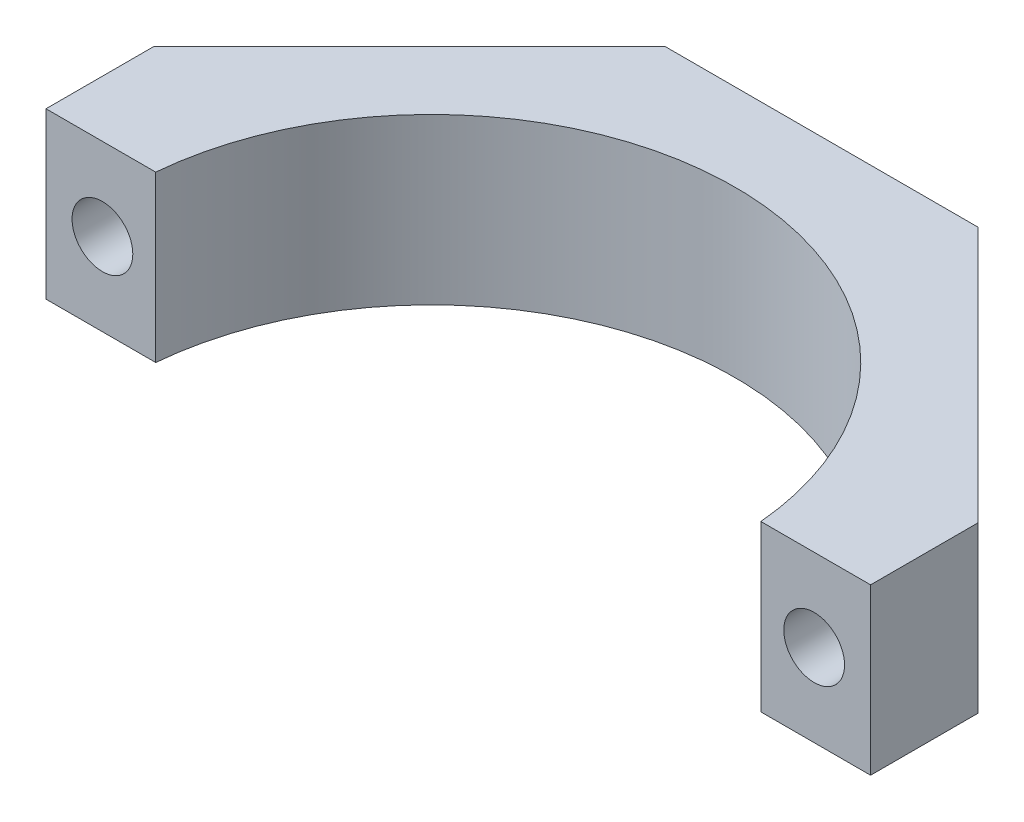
from build123d import *

# Parameters (mm, degrees)
EXTRUDE1_DEPTH          = 9.652
CUT_EXTRUDE1_DEPTH      = 52.446757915
CUT_EXTRUDE1_DEPTH_BACK = 52.446757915
SKETCH2_R               = 1.778
SKETCH3_R               = 3.175
CUT_EXTRUDE2_DEPTH      = 52.446757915
SKETCH4_W               = 50.633246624
SKETCH4_H               = 16.558924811
CUT_EXTRUDE3_DEPTH      = 1.5875


with BuildPart() as part:
    # Sketch1 → Extrude1 (new body)
    with BuildSketch(Plane(origin=(0, 0, 0), x_dir=(1, 0, 0), z_dir=(0, 1, 0))):
        with BuildLine():
            Line((0, 0), (0, 7.874))
            Line((0, 7.874), (14.986, 22.86))
            Line((14.986, 22.86), (33.274, 22.86))
            Line((33.274, 22.86), (48.26, 7.874))
            Line((48.26, 7.874), (48.26, 0))
            Line((48.26, 0), (41.91, 0))
            ThreePointArc((41.91, 0), (24.13, 17.78), (6.35, 0))
            Line((6.35, 0), (0, 0))
        make_face()
    extrude(amount=EXTRUDE1_DEPTH)

    # Sketch2 → Cut-Extrude1 (cut, two sides: drawn at the far end of the back side and taken through both)
    with BuildSketch(Plane.XY.offset(-7.874).offset(-CUT_EXTRUDE1_DEPTH_BACK)):
        with Locations((3.302, 4.826)):
            Circle(SKETCH2_R)
        with Locations((44.958, 4.826)):
            Circle(SKETCH2_R)
    extrude(amount=CUT_EXTRUDE1_DEPTH + CUT_EXTRUDE1_DEPTH_BACK, mode=Mode.SUBTRACT)

    # Sketch3 → Cut-Extrude2 (cut, through all)
    with BuildSketch(Plane.XY.offset(-7.874)):
        with Locations((3.302, 4.826)):
            Circle(SKETCH3_R)
        with Locations((44.958, 4.826)):
            Circle(SKETCH3_R)
    extrude(amount=-CUT_EXTRUDE2_DEPTH, mode=Mode.SUBTRACT)

    # Sketch4 → Cut-Extrude3 (cut)
    with BuildSketch(Plane.XY):
        with Locations((24.13, 4.258094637)):
            Rectangle(SKETCH4_W, SKETCH4_H)
    extrude(amount=-CUT_EXTRUDE3_DEPTH, mode=Mode.SUBTRACT)


solid = part.part
